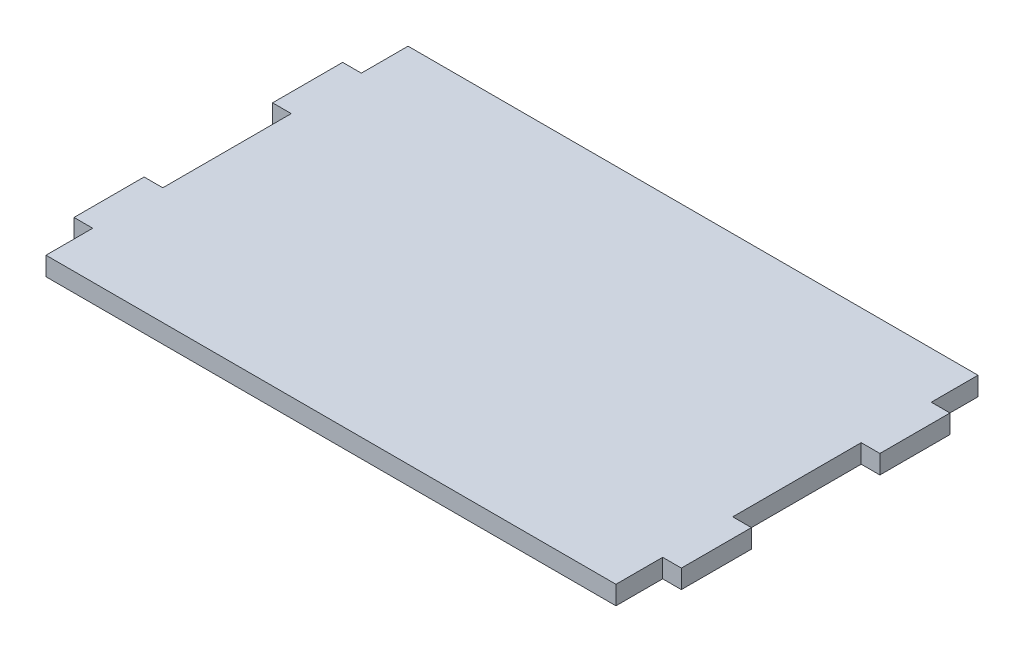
ISO-10303-21;
HEADER;
FILE_DESCRIPTION(('STEP AP214'),'2;1');
FILE_NAME('part.step','',(''),(''),'','','');
FILE_SCHEMA(('AUTOMOTIVE_DESIGN { 1 0 10303 214 1 1 1 1 }'));
ENDSEC;
DATA;
#1=APPLICATION_CONTEXT('core data for automotive mechanical design processes');
#2=APPLICATION_PROTOCOL_DEFINITION('international standard','automotive_design',2000,#1);
#3=PRODUCT_CONTEXT('',#1,'mechanical');
#4=PRODUCT('Part','Part','',(#3));
#5=PRODUCT_RELATED_PRODUCT_CATEGORY('part','',(#4));
#6=PRODUCT_DEFINITION_FORMATION('','',#4);
#7=PRODUCT_DEFINITION_CONTEXT('part definition',#1,'design');
#8=PRODUCT_DEFINITION('design','',#6,#7);
#9=PRODUCT_DEFINITION_SHAPE('','',#8);
#10=(LENGTH_UNIT() NAMED_UNIT(*) SI_UNIT(.MILLI.,.METRE.));
#11=(NAMED_UNIT(*) PLANE_ANGLE_UNIT() SI_UNIT($,.RADIAN.));
#12=(NAMED_UNIT(*) SI_UNIT($,.STERADIAN.) SOLID_ANGLE_UNIT());
#13=UNCERTAINTY_MEASURE_WITH_UNIT(LENGTH_MEASURE(1.E-05),#10,'distance_accuracy_value','');
#14=(GEOMETRIC_REPRESENTATION_CONTEXT(3) GLOBAL_UNCERTAINTY_ASSIGNED_CONTEXT((#13)) GLOBAL_UNIT_ASSIGNED_CONTEXT((#10,
#11,#12)) REPRESENTATION_CONTEXT('',''));
#15=CARTESIAN_POINT('',(0.,0.,0.));
#16=DIRECTION('',(0.,0.,1.));
#17=DIRECTION('',(1.,0.,0.));
#18=AXIS2_PLACEMENT_3D('',#15,#16,#17);
#19=CARTESIAN_POINT('',(61.,4.,-13.75));
#20=DIRECTION('',(-1.,0.,0.));
#21=DIRECTION('',(0.,0.,1.));
#22=AXIS2_PLACEMENT_3D('',#19,#20,#21);
#23=PLANE('',#22);
#24=DIRECTION('',(0.,0.,-1.));
#25=VECTOR('',#24,1.);
#26=CARTESIAN_POINT('',(61.,0.,-13.75));
#27=LINE('',#26,#25);
#28=CARTESIAN_POINT('',(61.,0.,13.75));
#29=VERTEX_POINT('',#28);
#30=CARTESIAN_POINT('',(61.,0.,-13.75));
#31=VERTEX_POINT('',#30);
#32=EDGE_CURVE('E201',#29,#31,#27,.T.);
#33=ORIENTED_EDGE('',*,*,#32,.T.);
#34=DIRECTION('',(0.,-1.,0.));
#35=VECTOR('',#34,1.);
#36=CARTESIAN_POINT('',(61.,4.,-13.75));
#37=LINE('',#36,#35);
#38=CARTESIAN_POINT('',(61.,4.,-13.75));
#39=VERTEX_POINT('',#38);
#40=EDGE_CURVE('E11',#39,#31,#37,.T.);
#41=ORIENTED_EDGE('',*,*,#40,.F.);
#42=DIRECTION('',(0.,0.,-1.));
#43=VECTOR('',#42,1.);
#44=CARTESIAN_POINT('',(61.,4.,-13.75));
#45=LINE('',#44,#43);
#46=CARTESIAN_POINT('',(61.,4.,13.75));
#47=VERTEX_POINT('',#46);
#48=EDGE_CURVE('E239',#47,#39,#45,.T.);
#49=ORIENTED_EDGE('',*,*,#48,.F.);
#50=DIRECTION('',(0.,-1.,0.));
#51=VECTOR('',#50,1.);
#52=CARTESIAN_POINT('',(61.,4.,13.75));
#53=LINE('',#52,#51);
#54=EDGE_CURVE('E197',#47,#29,#53,.T.);
#55=ORIENTED_EDGE('',*,*,#54,.T.);
#56=EDGE_LOOP('',(#33,#41,#49,#55));
#57=FACE_BOUND('',#56,.T.);
#58=ADVANCED_FACE('F33',(#57),#23,.F.);
#59=CARTESIAN_POINT('',(61.,4.,-13.75));
#60=DIRECTION('',(0.,0.,-1.));
#61=DIRECTION('',(-1.,0.,0.));
#62=AXIS2_PLACEMENT_3D('',#59,#60,#61);
#63=PLANE('',#62);
#64=DIRECTION('',(1.,0.,0.));
#65=VECTOR('',#64,1.);
#66=CARTESIAN_POINT('',(61.,0.,-13.75));
#67=LINE('',#66,#65);
#68=CARTESIAN_POINT('',(65.,0.,-13.75));
#69=VERTEX_POINT('',#68);
#70=EDGE_CURVE('E204',#31,#69,#67,.T.);
#71=ORIENTED_EDGE('',*,*,#70,.T.);
#72=DIRECTION('',(0.,-1.,0.));
#73=VECTOR('',#72,1.);
#74=CARTESIAN_POINT('',(65.,4.,-13.75));
#75=LINE('',#74,#73);
#76=CARTESIAN_POINT('',(65.,4.,-13.75));
#77=VERTEX_POINT('',#76);
#78=EDGE_CURVE('E41',#77,#69,#75,.T.);
#79=ORIENTED_EDGE('',*,*,#78,.F.);
#80=DIRECTION('',(1.,0.,0.));
#81=VECTOR('',#80,1.);
#82=CARTESIAN_POINT('',(61.,4.,-13.75));
#83=LINE('',#82,#81);
#84=EDGE_CURVE('E128',#39,#77,#83,.T.);
#85=ORIENTED_EDGE('',*,*,#84,.F.);
#86=ORIENTED_EDGE('',*,*,#40,.T.);
#87=EDGE_LOOP('',(#71,#79,#85,#86));
#88=FACE_BOUND('',#87,.T.);
#89=ADVANCED_FACE('F357',(#88),#63,.F.);
#90=CARTESIAN_POINT('',(65.,4.,-28.75));
#91=DIRECTION('',(-1.,0.,0.));
#92=DIRECTION('',(0.,0.,1.));
#93=AXIS2_PLACEMENT_3D('',#90,#91,#92);
#94=PLANE('',#93);
#95=DIRECTION('',(0.,0.,-1.));
#96=VECTOR('',#95,1.);
#97=CARTESIAN_POINT('',(65.,0.,-28.75));
#98=LINE('',#97,#96);
#99=CARTESIAN_POINT('',(65.,0.,-28.75));
#100=VERTEX_POINT('',#99);
#101=EDGE_CURVE('E206',#69,#100,#98,.T.);
#102=ORIENTED_EDGE('',*,*,#101,.T.);
#103=DIRECTION('',(0.,-1.,0.));
#104=VECTOR('',#103,1.);
#105=CARTESIAN_POINT('',(65.,4.,-28.75));
#106=LINE('',#105,#104);
#107=CARTESIAN_POINT('',(65.,4.,-28.75));
#108=VERTEX_POINT('',#107);
#109=EDGE_CURVE('E282',#108,#100,#106,.T.);
#110=ORIENTED_EDGE('',*,*,#109,.F.);
#111=DIRECTION('',(0.,0.,-1.));
#112=VECTOR('',#111,1.);
#113=CARTESIAN_POINT('',(65.,4.,-28.75));
#114=LINE('',#113,#112);
#115=EDGE_CURVE('E290',#77,#108,#114,.T.);
#116=ORIENTED_EDGE('',*,*,#115,.F.);
#117=ORIENTED_EDGE('',*,*,#78,.T.);
#118=EDGE_LOOP('',(#102,#110,#116,#117));
#119=FACE_BOUND('',#118,.T.);
#120=ADVANCED_FACE('F288',(#119),#94,.F.);
#121=CARTESIAN_POINT('',(61.,4.,-28.75));
#122=DIRECTION('',(0.,0.,1.));
#123=DIRECTION('',(1.,0.,0.));
#124=AXIS2_PLACEMENT_3D('',#121,#122,#123);
#125=PLANE('',#124);
#126=DIRECTION('',(-1.,0.,0.));
#127=VECTOR('',#126,1.);
#128=CARTESIAN_POINT('',(61.,0.,-28.75));
#129=LINE('',#128,#127);
#130=CARTESIAN_POINT('',(61.,0.,-28.75));
#131=VERTEX_POINT('',#130);
#132=EDGE_CURVE('E208',#100,#131,#129,.T.);
#133=ORIENTED_EDGE('',*,*,#132,.T.);
#134=DIRECTION('',(0.,-1.,0.));
#135=VECTOR('',#134,1.);
#136=CARTESIAN_POINT('',(61.,4.,-28.75));
#137=LINE('',#136,#135);
#138=CARTESIAN_POINT('',(61.,4.,-28.75));
#139=VERTEX_POINT('',#138);
#140=EDGE_CURVE('E279',#139,#131,#137,.T.);
#141=ORIENTED_EDGE('',*,*,#140,.F.);
#142=DIRECTION('',(-1.,0.,0.));
#143=VECTOR('',#142,1.);
#144=CARTESIAN_POINT('',(61.,4.,-28.75));
#145=LINE('',#144,#143);
#146=EDGE_CURVE('E308',#108,#139,#145,.T.);
#147=ORIENTED_EDGE('',*,*,#146,.F.);
#148=ORIENTED_EDGE('',*,*,#109,.T.);
#149=EDGE_LOOP('',(#133,#141,#147,#148));
#150=FACE_BOUND('',#149,.T.);
#151=ADVANCED_FACE('F299',(#150),#125,.F.);
#152=CARTESIAN_POINT('',(61.,4.,-38.75));
#153=DIRECTION('',(-1.,0.,0.));
#154=DIRECTION('',(0.,0.,1.));
#155=AXIS2_PLACEMENT_3D('',#152,#153,#154);
#156=PLANE('',#155);
#157=DIRECTION('',(0.,0.,-1.));
#158=VECTOR('',#157,1.);
#159=CARTESIAN_POINT('',(61.,0.,-38.75));
#160=LINE('',#159,#158);
#161=CARTESIAN_POINT('',(61.,0.,-38.75));
#162=VERTEX_POINT('',#161);
#163=EDGE_CURVE('E210',#131,#162,#160,.T.);
#164=ORIENTED_EDGE('',*,*,#163,.T.);
#165=DIRECTION('',(0.,-1.,0.));
#166=VECTOR('',#165,1.);
#167=CARTESIAN_POINT('',(61.,4.,-38.75));
#168=LINE('',#167,#166);
#169=CARTESIAN_POINT('',(61.,4.,-38.75));
#170=VERTEX_POINT('',#169);
#171=EDGE_CURVE('E276',#170,#162,#168,.T.);
#172=ORIENTED_EDGE('',*,*,#171,.F.);
#173=DIRECTION('',(0.,0.,-1.));
#174=VECTOR('',#173,1.);
#175=CARTESIAN_POINT('',(61.,4.,-38.75));
#176=LINE('',#175,#174);
#177=EDGE_CURVE('E305',#139,#170,#176,.T.);
#178=ORIENTED_EDGE('',*,*,#177,.F.);
#179=ORIENTED_EDGE('',*,*,#140,.T.);
#180=EDGE_LOOP('',(#164,#172,#178,#179));
#181=FACE_BOUND('',#180,.T.);
#182=ADVANCED_FACE('F303',(#181),#156,.F.);
#183=CARTESIAN_POINT('',(-61.,4.,-38.75));
#184=DIRECTION('',(0.,0.,1.));
#185=DIRECTION('',(1.,0.,0.));
#186=AXIS2_PLACEMENT_3D('',#183,#184,#185);
#187=PLANE('',#186);
#188=DIRECTION('',(-1.,0.,0.));
#189=VECTOR('',#188,1.);
#190=CARTESIAN_POINT('',(-61.,0.,-38.75));
#191=LINE('',#190,#189);
#192=CARTESIAN_POINT('',(-61.,0.,-38.75));
#193=VERTEX_POINT('',#192);
#194=EDGE_CURVE('E212',#162,#193,#191,.T.);
#195=ORIENTED_EDGE('',*,*,#194,.T.);
#196=DIRECTION('',(0.,-1.,0.));
#197=VECTOR('',#196,1.);
#198=CARTESIAN_POINT('',(-61.,4.,-38.75));
#199=LINE('',#198,#197);
#200=CARTESIAN_POINT('',(-61.,4.,-38.75));
#201=VERTEX_POINT('',#200);
#202=EDGE_CURVE('E273',#201,#193,#199,.T.);
#203=ORIENTED_EDGE('',*,*,#202,.F.);
#204=DIRECTION('',(-1.,0.,0.));
#205=VECTOR('',#204,1.);
#206=CARTESIAN_POINT('',(-61.,4.,-38.75));
#207=LINE('',#206,#205);
#208=EDGE_CURVE('E307',#170,#201,#207,.T.);
#209=ORIENTED_EDGE('',*,*,#208,.F.);
#210=ORIENTED_EDGE('',*,*,#171,.T.);
#211=EDGE_LOOP('',(#195,#203,#209,#210));
#212=FACE_BOUND('',#211,.T.);
#213=ADVANCED_FACE('F370',(#212),#187,.F.);
#214=CARTESIAN_POINT('',(-61.,4.,-38.75));
#215=DIRECTION('',(1.,0.,0.));
#216=DIRECTION('',(0.,0.,-1.));
#217=AXIS2_PLACEMENT_3D('',#214,#215,#216);
#218=PLANE('',#217);
#219=DIRECTION('',(0.,0.,1.));
#220=VECTOR('',#219,1.);
#221=CARTESIAN_POINT('',(-61.,0.,-38.75));
#222=LINE('',#221,#220);
#223=CARTESIAN_POINT('',(-61.,0.,-28.75));
#224=VERTEX_POINT('',#223);
#225=EDGE_CURVE('E214',#193,#224,#222,.T.);
#226=ORIENTED_EDGE('',*,*,#225,.T.);
#227=DIRECTION('',(0.,-1.,0.));
#228=VECTOR('',#227,1.);
#229=CARTESIAN_POINT('',(-61.,4.,-28.75));
#230=LINE('',#229,#228);
#231=CARTESIAN_POINT('',(-61.,4.,-28.75));
#232=VERTEX_POINT('',#231);
#233=EDGE_CURVE('E270',#232,#224,#230,.T.);
#234=ORIENTED_EDGE('',*,*,#233,.F.);
#235=DIRECTION('',(0.,0.,1.));
#236=VECTOR('',#235,1.);
#237=CARTESIAN_POINT('',(-61.,4.,-38.75));
#238=LINE('',#237,#236);
#239=EDGE_CURVE('E310',#201,#232,#238,.T.);
#240=ORIENTED_EDGE('',*,*,#239,.F.);
#241=ORIENTED_EDGE('',*,*,#202,.T.);
#242=EDGE_LOOP('',(#226,#234,#240,#241));
#243=FACE_BOUND('',#242,.T.);
#244=ADVANCED_FACE('F373',(#243),#218,.F.);
#245=CARTESIAN_POINT('',(-61.,4.,-28.75));
#246=DIRECTION('',(0.,0.,1.));
#247=DIRECTION('',(1.,0.,0.));
#248=AXIS2_PLACEMENT_3D('',#245,#246,#247);
#249=PLANE('',#248);
#250=DIRECTION('',(-1.,0.,0.));
#251=VECTOR('',#250,1.);
#252=CARTESIAN_POINT('',(-61.,0.,-28.75));
#253=LINE('',#252,#251);
#254=CARTESIAN_POINT('',(-65.,0.,-28.75));
#255=VERTEX_POINT('',#254);
#256=EDGE_CURVE('E216',#224,#255,#253,.T.);
#257=ORIENTED_EDGE('',*,*,#256,.T.);
#258=DIRECTION('',(0.,-1.,0.));
#259=VECTOR('',#258,1.);
#260=CARTESIAN_POINT('',(-65.,4.,-28.75));
#261=LINE('',#260,#259);
#262=CARTESIAN_POINT('',(-65.,4.,-28.75));
#263=VERTEX_POINT('',#262);
#264=EDGE_CURVE('E267',#263,#255,#261,.T.);
#265=ORIENTED_EDGE('',*,*,#264,.F.);
#266=DIRECTION('',(-1.,0.,0.));
#267=VECTOR('',#266,1.);
#268=CARTESIAN_POINT('',(-61.,4.,-28.75));
#269=LINE('',#268,#267);
#270=EDGE_CURVE('E316',#232,#263,#269,.T.);
#271=ORIENTED_EDGE('',*,*,#270,.F.);
#272=ORIENTED_EDGE('',*,*,#233,.T.);
#273=EDGE_LOOP('',(#257,#265,#271,#272));
#274=FACE_BOUND('',#273,.T.);
#275=ADVANCED_FACE('F377',(#274),#249,.F.);
#276=CARTESIAN_POINT('',(-65.,4.,-28.75));
#277=DIRECTION('',(1.,0.,0.));
#278=DIRECTION('',(0.,0.,-1.));
#279=AXIS2_PLACEMENT_3D('',#276,#277,#278);
#280=PLANE('',#279);
#281=DIRECTION('',(0.,0.,1.));
#282=VECTOR('',#281,1.);
#283=CARTESIAN_POINT('',(-65.,0.,-28.75));
#284=LINE('',#283,#282);
#285=CARTESIAN_POINT('',(-65.,0.,-13.75));
#286=VERTEX_POINT('',#285);
#287=EDGE_CURVE('E218',#255,#286,#284,.T.);
#288=ORIENTED_EDGE('',*,*,#287,.T.);
#289=DIRECTION('',(0.,-1.,0.));
#290=VECTOR('',#289,1.);
#291=CARTESIAN_POINT('',(-65.,4.,-13.75));
#292=LINE('',#291,#290);
#293=CARTESIAN_POINT('',(-65.,4.,-13.75));
#294=VERTEX_POINT('',#293);
#295=EDGE_CURVE('E264',#294,#286,#292,.T.);
#296=ORIENTED_EDGE('',*,*,#295,.F.);
#297=DIRECTION('',(0.,0.,1.));
#298=VECTOR('',#297,1.);
#299=CARTESIAN_POINT('',(-65.,4.,-28.75));
#300=LINE('',#299,#298);
#301=EDGE_CURVE('E318',#263,#294,#300,.T.);
#302=ORIENTED_EDGE('',*,*,#301,.F.);
#303=ORIENTED_EDGE('',*,*,#264,.T.);
#304=EDGE_LOOP('',(#288,#296,#302,#303));
#305=FACE_BOUND('',#304,.T.);
#306=ADVANCED_FACE('F381',(#305),#280,.F.);
#307=CARTESIAN_POINT('',(-65.,4.,-13.75));
#308=DIRECTION('',(0.,0.,-1.));
#309=DIRECTION('',(-1.,0.,0.));
#310=AXIS2_PLACEMENT_3D('',#307,#308,#309);
#311=PLANE('',#310);
#312=DIRECTION('',(1.,0.,0.));
#313=VECTOR('',#312,1.);
#314=CARTESIAN_POINT('',(-65.,0.,-13.75));
#315=LINE('',#314,#313);
#316=CARTESIAN_POINT('',(-61.,0.,-13.75));
#317=VERTEX_POINT('',#316);
#318=EDGE_CURVE('E220',#286,#317,#315,.T.);
#319=ORIENTED_EDGE('',*,*,#318,.T.);
#320=DIRECTION('',(0.,-1.,0.));
#321=VECTOR('',#320,1.);
#322=CARTESIAN_POINT('',(-61.,4.,-13.75));
#323=LINE('',#322,#321);
#324=CARTESIAN_POINT('',(-61.,4.,-13.75));
#325=VERTEX_POINT('',#324);
#326=EDGE_CURVE('E261',#325,#317,#323,.T.);
#327=ORIENTED_EDGE('',*,*,#326,.F.);
#328=DIRECTION('',(1.,0.,0.));
#329=VECTOR('',#328,1.);
#330=CARTESIAN_POINT('',(-65.,4.,-13.75));
#331=LINE('',#330,#329);
#332=EDGE_CURVE('E320',#294,#325,#331,.T.);
#333=ORIENTED_EDGE('',*,*,#332,.F.);
#334=ORIENTED_EDGE('',*,*,#295,.T.);
#335=EDGE_LOOP('',(#319,#327,#333,#334));
#336=FACE_BOUND('',#335,.T.);
#337=ADVANCED_FACE('F385',(#336),#311,.F.);
#338=CARTESIAN_POINT('',(-61.,4.,-13.75));
#339=DIRECTION('',(1.,0.,0.));
#340=DIRECTION('',(0.,0.,-1.));
#341=AXIS2_PLACEMENT_3D('',#338,#339,#340);
#342=PLANE('',#341);
#343=DIRECTION('',(0.,0.,1.));
#344=VECTOR('',#343,1.);
#345=CARTESIAN_POINT('',(-61.,0.,-13.75));
#346=LINE('',#345,#344);
#347=CARTESIAN_POINT('',(-61.,0.,13.75));
#348=VERTEX_POINT('',#347);
#349=EDGE_CURVE('E222',#317,#348,#346,.T.);
#350=ORIENTED_EDGE('',*,*,#349,.T.);
#351=DIRECTION('',(0.,-1.,0.));
#352=VECTOR('',#351,1.);
#353=CARTESIAN_POINT('',(-61.,4.,13.75));
#354=LINE('',#353,#352);
#355=CARTESIAN_POINT('',(-61.,4.,13.75));
#356=VERTEX_POINT('',#355);
#357=EDGE_CURVE('E258',#356,#348,#354,.T.);
#358=ORIENTED_EDGE('',*,*,#357,.F.);
#359=DIRECTION('',(0.,0.,1.));
#360=VECTOR('',#359,1.);
#361=CARTESIAN_POINT('',(-61.,4.,-13.75));
#362=LINE('',#361,#360);
#363=EDGE_CURVE('E322',#325,#356,#362,.T.);
#364=ORIENTED_EDGE('',*,*,#363,.F.);
#365=ORIENTED_EDGE('',*,*,#326,.T.);
#366=EDGE_LOOP('',(#350,#358,#364,#365));
#367=FACE_BOUND('',#366,.T.);
#368=ADVANCED_FACE('F389',(#367),#342,.F.);
#369=CARTESIAN_POINT('',(-61.,4.,13.75));
#370=DIRECTION('',(0.,0.,1.));
#371=DIRECTION('',(1.,0.,0.));
#372=AXIS2_PLACEMENT_3D('',#369,#370,#371);
#373=PLANE('',#372);
#374=DIRECTION('',(-1.,0.,0.));
#375=VECTOR('',#374,1.);
#376=CARTESIAN_POINT('',(-61.,0.,13.75));
#377=LINE('',#376,#375);
#378=CARTESIAN_POINT('',(-65.,0.,13.75));
#379=VERTEX_POINT('',#378);
#380=EDGE_CURVE('E224',#348,#379,#377,.T.);
#381=ORIENTED_EDGE('',*,*,#380,.T.);
#382=DIRECTION('',(0.,-1.,0.));
#383=VECTOR('',#382,1.);
#384=CARTESIAN_POINT('',(-65.,4.,13.75));
#385=LINE('',#384,#383);
#386=CARTESIAN_POINT('',(-65.,4.,13.75));
#387=VERTEX_POINT('',#386);
#388=EDGE_CURVE('E255',#387,#379,#385,.T.);
#389=ORIENTED_EDGE('',*,*,#388,.F.);
#390=DIRECTION('',(-1.,0.,0.));
#391=VECTOR('',#390,1.);
#392=CARTESIAN_POINT('',(-61.,4.,13.75));
#393=LINE('',#392,#391);
#394=EDGE_CURVE('E324',#356,#387,#393,.T.);
#395=ORIENTED_EDGE('',*,*,#394,.F.);
#396=ORIENTED_EDGE('',*,*,#357,.T.);
#397=EDGE_LOOP('',(#381,#389,#395,#396));
#398=FACE_BOUND('',#397,.T.);
#399=ADVANCED_FACE('F393',(#398),#373,.F.);
#400=CARTESIAN_POINT('',(-64.9999999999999,4.,28.75));
#401=DIRECTION('',(1.,0.,0.));
#402=DIRECTION('',(0.,0.,-1.));
#403=AXIS2_PLACEMENT_3D('',#400,#401,#402);
#404=PLANE('',#403);
#405=DIRECTION('',(0.,0.,1.));
#406=VECTOR('',#405,1.);
#407=CARTESIAN_POINT('',(-64.9999999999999,0.,28.75));
#408=LINE('',#407,#406);
#409=CARTESIAN_POINT('',(-64.9999999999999,0.,28.75));
#410=VERTEX_POINT('',#409);
#411=EDGE_CURVE('E226',#379,#410,#408,.T.);
#412=ORIENTED_EDGE('',*,*,#411,.T.);
#413=DIRECTION('',(0.,-1.,0.));
#414=VECTOR('',#413,1.);
#415=CARTESIAN_POINT('',(-64.9999999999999,4.,28.75));
#416=LINE('',#415,#414);
#417=CARTESIAN_POINT('',(-64.9999999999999,4.,28.75));
#418=VERTEX_POINT('',#417);
#419=EDGE_CURVE('E252',#418,#410,#416,.T.);
#420=ORIENTED_EDGE('',*,*,#419,.F.);
#421=DIRECTION('',(0.,0.,1.));
#422=VECTOR('',#421,1.);
#423=CARTESIAN_POINT('',(-64.9999999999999,4.,28.75));
#424=LINE('',#423,#422);
#425=EDGE_CURVE('E326',#387,#418,#424,.T.);
#426=ORIENTED_EDGE('',*,*,#425,.F.);
#427=ORIENTED_EDGE('',*,*,#388,.T.);
#428=EDGE_LOOP('',(#412,#420,#426,#427));
#429=FACE_BOUND('',#428,.T.);
#430=ADVANCED_FACE('F397',(#429),#404,.F.);
#431=CARTESIAN_POINT('',(-64.9999999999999,4.,28.75));
#432=DIRECTION('',(0.,0.,-1.));
#433=DIRECTION('',(-1.,0.,0.));
#434=AXIS2_PLACEMENT_3D('',#431,#432,#433);
#435=PLANE('',#434);
#436=DIRECTION('',(1.,0.,0.));
#437=VECTOR('',#436,1.);
#438=CARTESIAN_POINT('',(-64.9999999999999,0.,28.75));
#439=LINE('',#438,#437);
#440=CARTESIAN_POINT('',(-60.9999999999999,0.,28.75));
#441=VERTEX_POINT('',#440);
#442=EDGE_CURVE('E228',#410,#441,#439,.T.);
#443=ORIENTED_EDGE('',*,*,#442,.T.);
#444=DIRECTION('',(0.,-1.,0.));
#445=VECTOR('',#444,1.);
#446=CARTESIAN_POINT('',(-60.9999999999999,4.,28.75));
#447=LINE('',#446,#445);
#448=CARTESIAN_POINT('',(-60.9999999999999,4.,28.75));
#449=VERTEX_POINT('',#448);
#450=EDGE_CURVE('E249',#449,#441,#447,.T.);
#451=ORIENTED_EDGE('',*,*,#450,.F.);
#452=DIRECTION('',(1.,0.,0.));
#453=VECTOR('',#452,1.);
#454=CARTESIAN_POINT('',(-64.9999999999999,4.,28.75));
#455=LINE('',#454,#453);
#456=EDGE_CURVE('E328',#418,#449,#455,.T.);
#457=ORIENTED_EDGE('',*,*,#456,.F.);
#458=ORIENTED_EDGE('',*,*,#419,.T.);
#459=EDGE_LOOP('',(#443,#451,#457,#458));
#460=FACE_BOUND('',#459,.T.);
#461=ADVANCED_FACE('F401',(#460),#435,.F.);
#462=CARTESIAN_POINT('',(-60.9999999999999,4.,28.75));
#463=DIRECTION('',(1.,0.,0.));
#464=DIRECTION('',(0.,0.,-1.));
#465=AXIS2_PLACEMENT_3D('',#462,#463,#464);
#466=PLANE('',#465);
#467=DIRECTION('',(0.,0.,1.));
#468=VECTOR('',#467,1.);
#469=CARTESIAN_POINT('',(-60.9999999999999,0.,28.75));
#470=LINE('',#469,#468);
#471=CARTESIAN_POINT('',(-61.,0.,38.75));
#472=VERTEX_POINT('',#471);
#473=EDGE_CURVE('E230',#441,#472,#470,.T.);
#474=ORIENTED_EDGE('',*,*,#473,.T.);
#475=DIRECTION('',(0.,-1.,0.));
#476=VECTOR('',#475,1.);
#477=CARTESIAN_POINT('',(-61.,4.,38.75));
#478=LINE('',#477,#476);
#479=CARTESIAN_POINT('',(-61.,4.,38.75));
#480=VERTEX_POINT('',#479);
#481=EDGE_CURVE('E246',#480,#472,#478,.T.);
#482=ORIENTED_EDGE('',*,*,#481,.F.);
#483=DIRECTION('',(0.,0.,1.));
#484=VECTOR('',#483,1.);
#485=CARTESIAN_POINT('',(-60.9999999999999,4.,28.75));
#486=LINE('',#485,#484);
#487=EDGE_CURVE('E330',#449,#480,#486,.T.);
#488=ORIENTED_EDGE('',*,*,#487,.F.);
#489=ORIENTED_EDGE('',*,*,#450,.T.);
#490=EDGE_LOOP('',(#474,#482,#488,#489));
#491=FACE_BOUND('',#490,.T.);
#492=ADVANCED_FACE('F405',(#491),#466,.F.);
#493=CARTESIAN_POINT('',(-61.,4.,38.75));
#494=DIRECTION('',(0.,0.,-1.));
#495=DIRECTION('',(-1.,0.,0.));
#496=AXIS2_PLACEMENT_3D('',#493,#494,#495);
#497=PLANE('',#496);
#498=DIRECTION('',(1.,0.,0.));
#499=VECTOR('',#498,1.);
#500=CARTESIAN_POINT('',(-61.,0.,38.75));
#501=LINE('',#500,#499);
#502=CARTESIAN_POINT('',(61.,0.,38.75));
#503=VERTEX_POINT('',#502);
#504=EDGE_CURVE('E232',#472,#503,#501,.T.);
#505=ORIENTED_EDGE('',*,*,#504,.T.);
#506=DIRECTION('',(0.,-1.,0.));
#507=VECTOR('',#506,1.);
#508=CARTESIAN_POINT('',(61.,4.,38.75));
#509=LINE('',#508,#507);
#510=CARTESIAN_POINT('',(61.,4.,38.75));
#511=VERTEX_POINT('',#510);
#512=EDGE_CURVE('E243',#511,#503,#509,.T.);
#513=ORIENTED_EDGE('',*,*,#512,.F.);
#514=DIRECTION('',(1.,0.,0.));
#515=VECTOR('',#514,1.);
#516=CARTESIAN_POINT('',(-61.,4.,38.75));
#517=LINE('',#516,#515);
#518=EDGE_CURVE('E332',#480,#511,#517,.T.);
#519=ORIENTED_EDGE('',*,*,#518,.F.);
#520=ORIENTED_EDGE('',*,*,#481,.T.);
#521=EDGE_LOOP('',(#505,#513,#519,#520));
#522=FACE_BOUND('',#521,.T.);
#523=ADVANCED_FACE('F338',(#522),#497,.F.);
#524=CARTESIAN_POINT('',(60.9999999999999,4.,28.75));
#525=DIRECTION('',(-1.,0.,0.));
#526=DIRECTION('',(0.,0.,1.));
#527=AXIS2_PLACEMENT_3D('',#524,#525,#526);
#528=PLANE('',#527);
#529=DIRECTION('',(0.,0.,-1.));
#530=VECTOR('',#529,1.);
#531=CARTESIAN_POINT('',(60.9999999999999,0.,28.75));
#532=LINE('',#531,#530);
#533=CARTESIAN_POINT('',(60.9999999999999,0.,28.75));
#534=VERTEX_POINT('',#533);
#535=EDGE_CURVE('E234',#503,#534,#532,.T.);
#536=ORIENTED_EDGE('',*,*,#535,.T.);
#537=DIRECTION('',(0.,-1.,0.));
#538=VECTOR('',#537,1.);
#539=CARTESIAN_POINT('',(60.9999999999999,4.,28.75));
#540=LINE('',#539,#538);
#541=CARTESIAN_POINT('',(60.9999999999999,4.,28.75));
#542=VERTEX_POINT('',#541);
#543=EDGE_CURVE('E192',#542,#534,#540,.T.);
#544=ORIENTED_EDGE('',*,*,#543,.F.);
#545=DIRECTION('',(0.,0.,-1.));
#546=VECTOR('',#545,1.);
#547=CARTESIAN_POINT('',(60.9999999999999,4.,28.75));
#548=LINE('',#547,#546);
#549=EDGE_CURVE('E183',#511,#542,#548,.T.);
#550=ORIENTED_EDGE('',*,*,#549,.F.);
#551=ORIENTED_EDGE('',*,*,#512,.T.);
#552=EDGE_LOOP('',(#536,#544,#550,#551));
#553=FACE_BOUND('',#552,.T.);
#554=ADVANCED_FACE('F342',(#553),#528,.F.);
#555=CARTESIAN_POINT('',(60.9999999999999,4.,28.75));
#556=DIRECTION('',(0.,0.,-1.));
#557=DIRECTION('',(-1.,0.,0.));
#558=AXIS2_PLACEMENT_3D('',#555,#556,#557);
#559=PLANE('',#558);
#560=DIRECTION('',(1.,0.,0.));
#561=VECTOR('',#560,1.);
#562=CARTESIAN_POINT('',(60.9999999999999,0.,28.75));
#563=LINE('',#562,#561);
#564=CARTESIAN_POINT('',(64.9999999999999,0.,28.75));
#565=VERTEX_POINT('',#564);
#566=EDGE_CURVE('E191',#534,#565,#563,.T.);
#567=ORIENTED_EDGE('',*,*,#566,.T.);
#568=DIRECTION('',(0.,-1.,0.));
#569=VECTOR('',#568,1.);
#570=CARTESIAN_POINT('',(64.9999999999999,4.,28.75));
#571=LINE('',#570,#569);
#572=CARTESIAN_POINT('',(64.9999999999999,4.,28.75));
#573=VERTEX_POINT('',#572);
#574=EDGE_CURVE('E188',#573,#565,#571,.T.);
#575=ORIENTED_EDGE('',*,*,#574,.F.);
#576=DIRECTION('',(1.,0.,0.));
#577=VECTOR('',#576,1.);
#578=CARTESIAN_POINT('',(60.9999999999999,4.,28.75));
#579=LINE('',#578,#577);
#580=EDGE_CURVE('E177',#542,#573,#579,.T.);
#581=ORIENTED_EDGE('',*,*,#580,.F.);
#582=ORIENTED_EDGE('',*,*,#543,.T.);
#583=EDGE_LOOP('',(#567,#575,#581,#582));
#584=FACE_BOUND('',#583,.T.);
#585=ADVANCED_FACE('F189',(#584),#559,.F.);
#586=CARTESIAN_POINT('',(64.9999999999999,4.,28.75));
#587=DIRECTION('',(-1.,0.,0.));
#588=DIRECTION('',(0.,0.,1.));
#589=AXIS2_PLACEMENT_3D('',#586,#587,#588);
#590=PLANE('',#589);
#591=DIRECTION('',(0.,0.,-1.));
#592=VECTOR('',#591,1.);
#593=CARTESIAN_POINT('',(64.9999999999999,0.,28.75));
#594=LINE('',#593,#592);
#595=CARTESIAN_POINT('',(65.,0.,13.75));
#596=VERTEX_POINT('',#595);
#597=EDGE_CURVE('E114',#565,#596,#594,.T.);
#598=ORIENTED_EDGE('',*,*,#597,.T.);
#599=DIRECTION('',(0.,-1.,0.));
#600=VECTOR('',#599,1.);
#601=CARTESIAN_POINT('',(65.,4.,13.75));
#602=LINE('',#601,#600);
#603=CARTESIAN_POINT('',(65.,4.,13.75));
#604=VERTEX_POINT('',#603);
#605=EDGE_CURVE('E193',#604,#596,#602,.T.);
#606=ORIENTED_EDGE('',*,*,#605,.F.);
#607=DIRECTION('',(0.,0.,-1.));
#608=VECTOR('',#607,1.);
#609=CARTESIAN_POINT('',(64.9999999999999,4.,28.75));
#610=LINE('',#609,#608);
#611=EDGE_CURVE('E181',#573,#604,#610,.T.);
#612=ORIENTED_EDGE('',*,*,#611,.F.);
#613=ORIENTED_EDGE('',*,*,#574,.T.);
#614=EDGE_LOOP('',(#598,#606,#612,#613));
#615=FACE_BOUND('',#614,.T.);
#616=ADVANCED_FACE('F195',(#615),#590,.F.);
#617=CARTESIAN_POINT('',(61.,4.,13.75));
#618=DIRECTION('',(0.,0.,1.));
#619=DIRECTION('',(1.,0.,0.));
#620=AXIS2_PLACEMENT_3D('',#617,#618,#619);
#621=PLANE('',#620);
#622=DIRECTION('',(-1.,0.,0.));
#623=VECTOR('',#622,1.);
#624=CARTESIAN_POINT('',(61.,0.,13.75));
#625=LINE('',#624,#623);
#626=EDGE_CURVE('E120',#596,#29,#625,.T.);
#627=ORIENTED_EDGE('',*,*,#626,.T.);
#628=ORIENTED_EDGE('',*,*,#54,.F.);
#629=DIRECTION('',(-1.,0.,0.));
#630=VECTOR('',#629,1.);
#631=CARTESIAN_POINT('',(61.,4.,13.75));
#632=LINE('',#631,#630);
#633=EDGE_CURVE('E49',#604,#47,#632,.T.);
#634=ORIENTED_EDGE('',*,*,#633,.F.);
#635=ORIENTED_EDGE('',*,*,#605,.T.);
#636=EDGE_LOOP('',(#627,#628,#634,#635));
#637=FACE_BOUND('',#636,.T.);
#638=ADVANCED_FACE('F346',(#637),#621,.F.);
#639=CARTESIAN_POINT('',(0.,4.,0.));
#640=DIRECTION('',(0.,1.,0.));
#641=DIRECTION('',(0.,0.,1.));
#642=AXIS2_PLACEMENT_3D('',#639,#640,#641);
#643=PLANE('',#642);
#644=ORIENTED_EDGE('',*,*,#48,.T.);
#645=ORIENTED_EDGE('',*,*,#84,.T.);
#646=ORIENTED_EDGE('',*,*,#115,.T.);
#647=ORIENTED_EDGE('',*,*,#146,.T.);
#648=ORIENTED_EDGE('',*,*,#177,.T.);
#649=ORIENTED_EDGE('',*,*,#208,.T.);
#650=ORIENTED_EDGE('',*,*,#239,.T.);
#651=ORIENTED_EDGE('',*,*,#270,.T.);
#652=ORIENTED_EDGE('',*,*,#301,.T.);
#653=ORIENTED_EDGE('',*,*,#332,.T.);
#654=ORIENTED_EDGE('',*,*,#363,.T.);
#655=ORIENTED_EDGE('',*,*,#394,.T.);
#656=ORIENTED_EDGE('',*,*,#425,.T.);
#657=ORIENTED_EDGE('',*,*,#456,.T.);
#658=ORIENTED_EDGE('',*,*,#487,.T.);
#659=ORIENTED_EDGE('',*,*,#518,.T.);
#660=ORIENTED_EDGE('',*,*,#549,.T.);
#661=ORIENTED_EDGE('',*,*,#580,.T.);
#662=ORIENTED_EDGE('',*,*,#611,.T.);
#663=ORIENTED_EDGE('',*,*,#633,.T.);
#664=EDGE_LOOP('',(#644,#645,#646,#647,#648,#649,#650,#651,#652,#653,#654,#655,#656,#657,#658,
#659,#660,#661,#662,#663));
#665=FACE_BOUND('',#664,.T.);
#666=ADVANCED_FACE('F179',(#665),#643,.T.);
#667=CARTESIAN_POINT('',(0.,0.,0.));
#668=DIRECTION('',(0.,1.,0.));
#669=DIRECTION('',(0.,0.,1.));
#670=AXIS2_PLACEMENT_3D('',#667,#668,#669);
#671=PLANE('',#670);
#672=ORIENTED_EDGE('',*,*,#32,.F.);
#673=ORIENTED_EDGE('',*,*,#626,.F.);
#674=ORIENTED_EDGE('',*,*,#597,.F.);
#675=ORIENTED_EDGE('',*,*,#566,.F.);
#676=ORIENTED_EDGE('',*,*,#535,.F.);
#677=ORIENTED_EDGE('',*,*,#504,.F.);
#678=ORIENTED_EDGE('',*,*,#473,.F.);
#679=ORIENTED_EDGE('',*,*,#442,.F.);
#680=ORIENTED_EDGE('',*,*,#411,.F.);
#681=ORIENTED_EDGE('',*,*,#380,.F.);
#682=ORIENTED_EDGE('',*,*,#349,.F.);
#683=ORIENTED_EDGE('',*,*,#318,.F.);
#684=ORIENTED_EDGE('',*,*,#287,.F.);
#685=ORIENTED_EDGE('',*,*,#256,.F.);
#686=ORIENTED_EDGE('',*,*,#225,.F.);
#687=ORIENTED_EDGE('',*,*,#194,.F.);
#688=ORIENTED_EDGE('',*,*,#163,.F.);
#689=ORIENTED_EDGE('',*,*,#132,.F.);
#690=ORIENTED_EDGE('',*,*,#101,.F.);
#691=ORIENTED_EDGE('',*,*,#70,.F.);
#692=EDGE_LOOP('',(#672,#673,#674,#675,#676,#677,#678,#679,#680,#681,#682,#683,#684,#685,#686,
#687,#688,#689,#690,#691));
#693=FACE_BOUND('',#692,.T.);
#694=ADVANCED_FACE('F294',(#693),#671,.F.);
#695=CLOSED_SHELL('',(#58,#89,#120,#151,#182,#213,#244,#275,#306,#337,#368,#399,#430,#461,#492,
#523,#554,#585,#616,#638,#666,#694));
#696=MANIFOLD_SOLID_BREP('B2',#695);
#697=ADVANCED_BREP_SHAPE_REPRESENTATION('',(#18,#696),#14);
#698=SHAPE_DEFINITION_REPRESENTATION(#9,#697);
ENDSEC;
END-ISO-10303-21;
